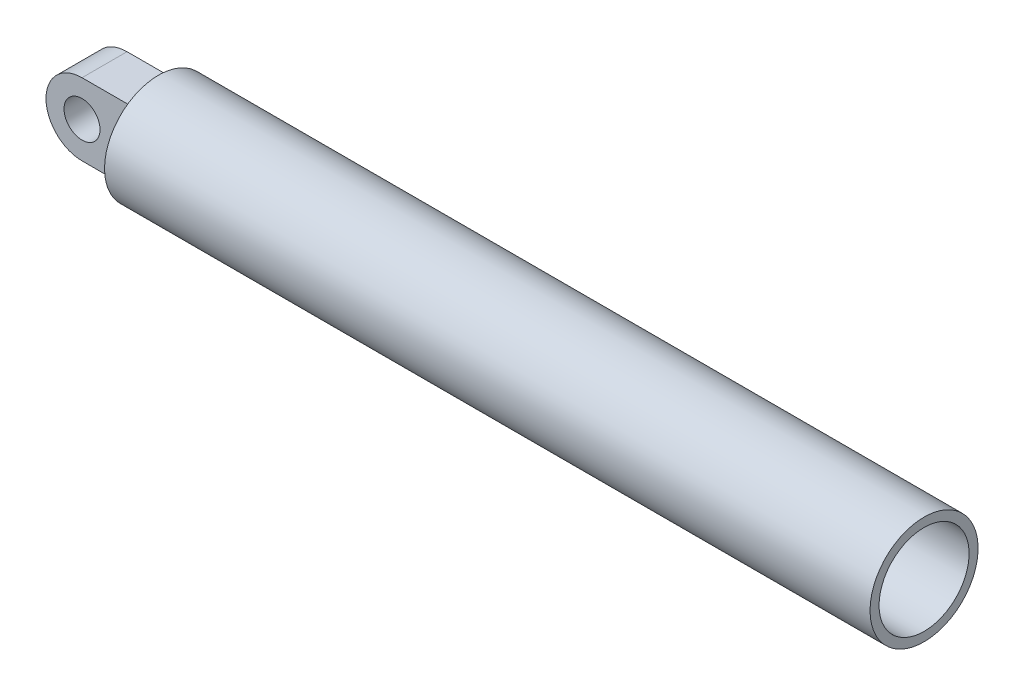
from build123d import *

# Parameters (mm, degrees)
SKETCH2_R           = 20
BOSS_EXTRUDE1_DEPTH = 25


with BuildPart() as part:
    # Sketch1 → Base-Revolve (revolve)
    with BuildSketch(Plane.XY, mode=Mode.PRIVATE) as base_revolve_sk:
        Polygon((0, 0), (0, 60), (850, 60), (850, 50), (25, 50), (25, 0), align=None)
    revolve(base_revolve_sk.sketch.rotate(Axis((0, 0, 0), (1, 0, 0)), 90), axis=Axis((0, 0, 0), (1, 0, 0)))

    # Sketch2 → Boss-Extrude1 (add, symmetric)
    with BuildSketch(Plane.XY):
        with BuildLine():
            Line((-60, 40), (0, 40))
            Line((0, 40), (0, -40))
            Line((0, -40), (-60, -40))
            ThreePointArc((-60, -40), (-100, 0), (-60, 40))
        make_face()
        with Locations((-60, 0)):
            Circle(SKETCH2_R, mode=Mode.SUBTRACT)
    extrude(amount=BOSS_EXTRUDE1_DEPTH, both=True)


solid = part.part
